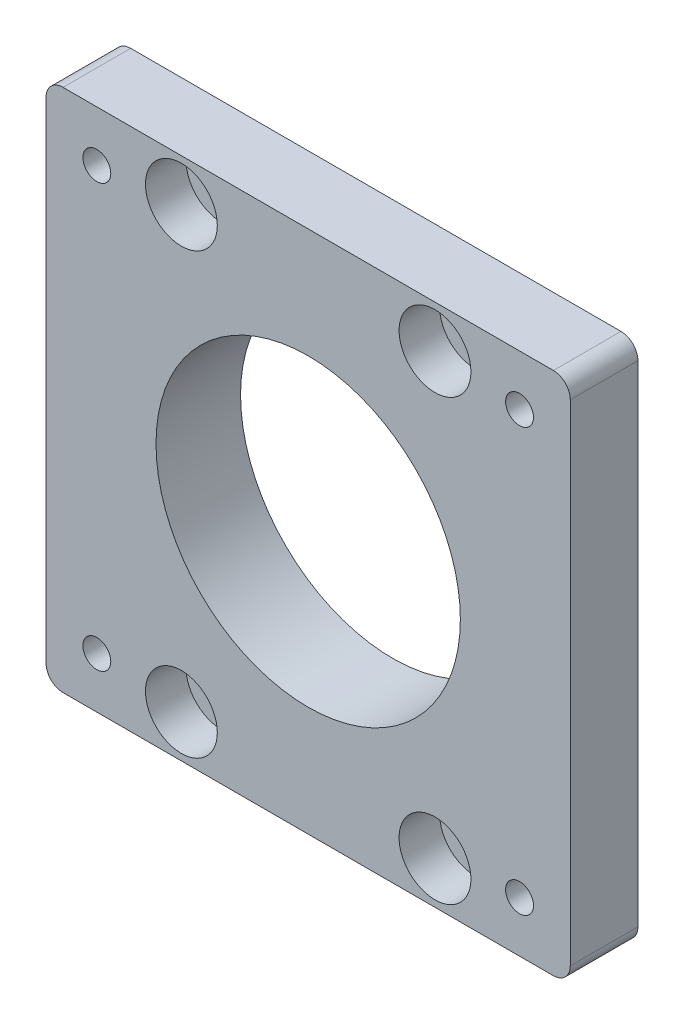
from build123d import *
from build123d.topology import SkipClean

# Parameters (mm, degrees)
SKETCH_1_W             = 62
SKETCH_1_H             = 62
SKETCH_1_R             = 18
EXTRUDE_1_DEPTH        = 8
SKETCH_2_R             = 1.25
CUT_EXTRUDE_1_DEPTH    = 45.56455991
SKETCH_5_R             = 2.25
CUT_EXTRUDE_3_DEPTH    = 45.56455991
SKETCH_6_R             = 4.25
CUT_EXTRUDE_4_DEPTH    = 4.8
FILLET_1_R             = 2
EXTRUDE_START          = 2
SKETCH_7_R             = 25
SKETCH_7_R_2           = 18
EXTRUDE_2_DEPTH        = 2
HOLE_WIZARD_M4_1_D     = 3.3
HOLE_WIZARD_M4_1_DEPTH = 13.4
HOLE_WIZARD_M4_1_TIP   = 0.991420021


with BuildPart() as part:
    # Sketch 1 → Extrude 1 (new body)
    with BuildSketch(Plane.XY):
        Rectangle(SKETCH_1_W, SKETCH_1_H)
        Circle(SKETCH_1_R, mode=Mode.SUBTRACT)
    extrude(amount=EXTRUDE_1_DEPTH)

    # Sketch 2 → Cut-Extrude 1 (cut, through all)
    with BuildSketch(Plane.XY.offset(8)):
        with Locations((-25, 25)):
            Circle(SKETCH_2_R)
        with Locations((25, 25)):
            Circle(SKETCH_2_R)
        with Locations((25, -25)):
            Circle(SKETCH_2_R)
        with Locations((-25, -25)):
            Circle(SKETCH_2_R)
    extrude(amount=-CUT_EXTRUDE_1_DEPTH, mode=Mode.SUBTRACT)

    # Sketch 5 → Cut-Extrude 3 (cut, through all)
    with BuildSketch(Plane.XY.offset(8)):
        with Locations((-15, 25.980762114)):
            Circle(SKETCH_5_R)
        with Locations((15, 25.980762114)):
            Circle(SKETCH_5_R)
        with Locations((15, -25.980762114)):
            Circle(SKETCH_5_R)
        with Locations((-15, -25.980762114)):
            Circle(SKETCH_5_R)
    extrude(amount=-CUT_EXTRUDE_3_DEPTH, mode=Mode.SUBTRACT)

    # Sketch 6 → Cut-Extrude 4 (cut)
    with BuildSketch(Plane.XY.offset(8)):
        with Locations((-15, 25.980762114)):
            Circle(SKETCH_6_R)
        with Locations((15, 25.980762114)):
            Circle(SKETCH_6_R)
        with Locations((15, -25.980762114)):
            Circle(SKETCH_6_R)
        with Locations((-15, -25.980762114)):
            Circle(SKETCH_6_R)
    extrude(amount=-CUT_EXTRUDE_4_DEPTH, mode=Mode.SUBTRACT)

    # Fillet 1
    fillet_1_edges = [part.edges().sort_by_distance(p)[0] for p in [
        (31, -31, 4),
        (-31, -31, 4),
        (-31, 31, 4),
        (31, 31, 4),
    ]]
    fillet(fillet_1_edges, radius=FILLET_1_R)

    # Sketch 7 → Extrude 2 (add)
    with SkipClean():  # the faces are left unmerged after this step: merging them gives an invalid solid
        with BuildSketch(Plane(origin=(0, 0, 0), x_dir=(-1, 0, 0), z_dir=(0, 0, -1)).offset(EXTRUDE_START)):
            Circle(SKETCH_7_R)
            Circle(SKETCH_7_R_2, mode=Mode.SUBTRACT)
        extrude(amount=-EXTRUDE_2_DEPTH)

    # Hole Wizard M4 _1
    with Locations(Plane.XY.offset(8)):
        with Locations((-25, 25), (-25, -25), (25, -25), (25, 25)):
            Hole(HOLE_WIZARD_M4_1_D / 2, depth=HOLE_WIZARD_M4_1_DEPTH)
            with Locations((0, 0, -(HOLE_WIZARD_M4_1_DEPTH + HOLE_WIZARD_M4_1_TIP / 2))):  # 118° drill point
                Cone(0, HOLE_WIZARD_M4_1_D / 2, HOLE_WIZARD_M4_1_TIP, mode=Mode.SUBTRACT)


solid = part.part
